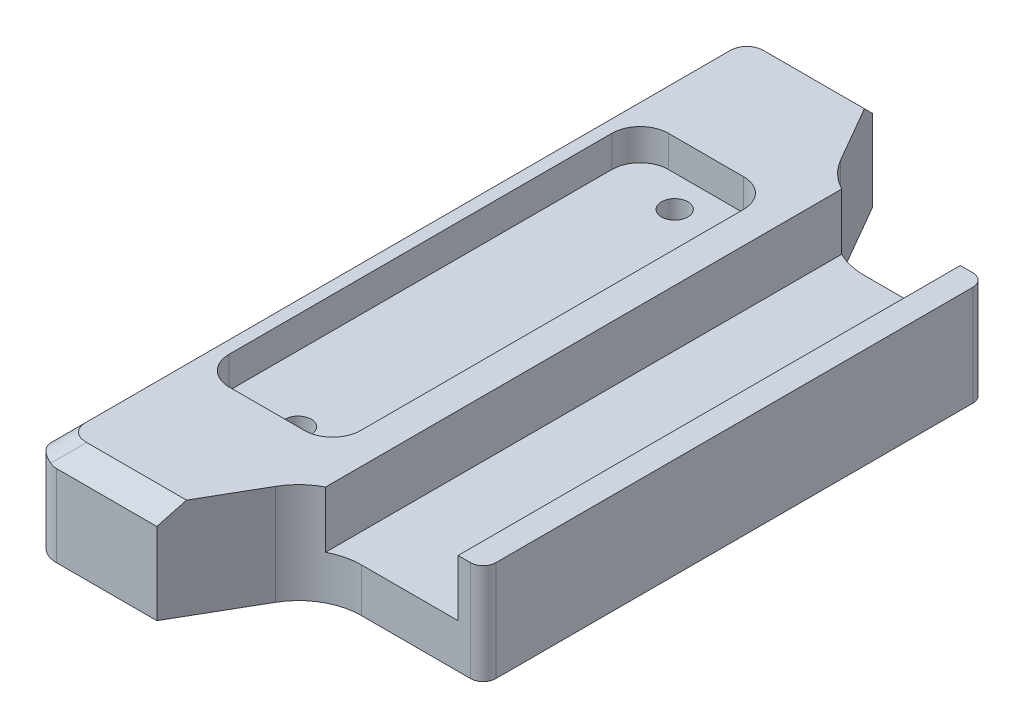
ISO-10303-21;
HEADER;
FILE_DESCRIPTION(('STEP AP214'),'2;1');
FILE_NAME('part.step','',(''),(''),'','','');
FILE_SCHEMA(('AUTOMOTIVE_DESIGN { 1 0 10303 214 1 1 1 1 }'));
ENDSEC;
DATA;
#1=APPLICATION_CONTEXT('core data for automotive mechanical design processes');
#2=APPLICATION_PROTOCOL_DEFINITION('international standard','automotive_design',2000,#1);
#3=PRODUCT_CONTEXT('',#1,'mechanical');
#4=PRODUCT('Part','Part','',(#3));
#5=PRODUCT_RELATED_PRODUCT_CATEGORY('part','',(#4));
#6=PRODUCT_DEFINITION_FORMATION('','',#4);
#7=PRODUCT_DEFINITION_CONTEXT('part definition',#1,'design');
#8=PRODUCT_DEFINITION('design','',#6,#7);
#9=PRODUCT_DEFINITION_SHAPE('','',#8);
#10=(LENGTH_UNIT() NAMED_UNIT(*) SI_UNIT(.MILLI.,.METRE.));
#11=(NAMED_UNIT(*) PLANE_ANGLE_UNIT() SI_UNIT($,.RADIAN.));
#12=(NAMED_UNIT(*) SI_UNIT($,.STERADIAN.) SOLID_ANGLE_UNIT());
#13=UNCERTAINTY_MEASURE_WITH_UNIT(LENGTH_MEASURE(1.E-05),#10,'distance_accuracy_value','');
#14=(GEOMETRIC_REPRESENTATION_CONTEXT(3) GLOBAL_UNCERTAINTY_ASSIGNED_CONTEXT((#13)) GLOBAL_UNIT_ASSIGNED_CONTEXT((#10,
#11,#12)) REPRESENTATION_CONTEXT('',''));
#15=CARTESIAN_POINT('',(0.,0.,0.));
#16=DIRECTION('',(0.,0.,1.));
#17=DIRECTION('',(1.,0.,0.));
#18=AXIS2_PLACEMENT_3D('',#15,#16,#17);
#19=CARTESIAN_POINT('',(0.,16.,57.));
#20=DIRECTION('',(0.,-1.,0.));
#21=DIRECTION('',(1.,0.,0.));
#22=AXIS2_PLACEMENT_3D('',#19,#20,#21);
#23=PLANE('',#22);
#24=DIRECTION('',(-1.,0.,0.));
#25=VECTOR('',#24,1.);
#26=CARTESIAN_POINT('',(55.,16.,40.));
#27=LINE('',#26,#25);
#28=CARTESIAN_POINT('',(53.,16.,40.));
#29=VERTEX_POINT('',#28);
#30=CARTESIAN_POINT('',(51.,16.,40.));
#31=VERTEX_POINT('',#30);
#32=EDGE_CURVE('E375',#29,#31,#27,.T.);
#33=ORIENTED_EDGE('',*,*,#32,.F.);
#34=CARTESIAN_POINT('',(53.,16.,38.));
#35=DIRECTION('',(0.,-1.,0.));
#36=DIRECTION('',(1.,0.,0.));
#37=AXIS2_PLACEMENT_3D('',#34,#35,#36);
#38=CIRCLE('',#37,2.);
#39=CARTESIAN_POINT('',(55.,16.,38.));
#40=VERTEX_POINT('',#39);
#41=EDGE_CURVE('E53',#29,#40,#38,.F.);
#42=ORIENTED_EDGE('',*,*,#41,.T.);
#43=DIRECTION('',(0.,0.,-1.));
#44=VECTOR('',#43,1.);
#45=CARTESIAN_POINT('',(55.,16.,57.));
#46=LINE('',#45,#44);
#47=CARTESIAN_POINT('',(55.,16.,-38.));
#48=VERTEX_POINT('',#47);
#49=EDGE_CURVE('E400',#40,#48,#46,.T.);
#50=ORIENTED_EDGE('',*,*,#49,.T.);
#51=CARTESIAN_POINT('',(53.,16.,-38.));
#52=DIRECTION('',(0.,-1.,0.));
#53=DIRECTION('',(1.,0.,0.));
#54=AXIS2_PLACEMENT_3D('',#51,#52,#53);
#55=CIRCLE('',#54,2.);
#56=CARTESIAN_POINT('',(53.,16.,-40.));
#57=VERTEX_POINT('',#56);
#58=EDGE_CURVE('E360',#48,#57,#55,.F.);
#59=ORIENTED_EDGE('',*,*,#58,.T.);
#60=DIRECTION('',(1.,0.,0.));
#61=VECTOR('',#60,1.);
#62=CARTESIAN_POINT('',(55.,16.,-40.));
#63=LINE('',#62,#61);
#64=CARTESIAN_POINT('',(51.,16.,-40.));
#65=VERTEX_POINT('',#64);
#66=EDGE_CURVE('E542',#65,#57,#63,.T.);
#67=ORIENTED_EDGE('',*,*,#66,.F.);
#68=DIRECTION('',(0.,0.,1.));
#69=VECTOR('',#68,1.);
#70=CARTESIAN_POINT('',(51.,16.,-57.));
#71=LINE('',#70,#69);
#72=EDGE_CURVE('E253',#65,#31,#71,.T.);
#73=ORIENTED_EDGE('',*,*,#72,.T.);
#74=EDGE_LOOP('',(#33,#42,#50,#59,#67,#73));
#75=FACE_BOUND('',#74,.T.);
#76=ADVANCED_FACE('F31',(#75),#23,.F.);
#77=CARTESIAN_POINT('',(0.,0.,57.));
#78=DIRECTION('',(0.,1.,0.));
#79=DIRECTION('',(-1.,0.,0.));
#80=AXIS2_PLACEMENT_3D('',#77,#78,#79);
#81=PLANE('',#80);
#82=CARTESIAN_POINT('',(15.5,0.,-30.));
#83=DIRECTION('',(0.,-1.,0.));
#84=DIRECTION('',(0.,0.,-1.));
#85=AXIS2_PLACEMENT_3D('',#82,#83,#84);
#86=CIRCLE('',#85,3.6);
#87=CARTESIAN_POINT('',(15.5,0.,-33.6));
#88=VERTEX_POINT('',#87);
#89=EDGE_CURVE('E583',#88,#88,#86,.T.);
#90=ORIENTED_EDGE('',*,*,#89,.F.);
#91=EDGE_LOOP('',(#90));
#92=FACE_BOUND('',#91,.T.);
#93=DIRECTION('',(0.,0.,-1.));
#94=VECTOR('',#93,1.);
#95=CARTESIAN_POINT('',(55.,0.,57.));
#96=LINE('',#95,#94);
#97=CARTESIAN_POINT('',(55.,0.,38.));
#98=VERTEX_POINT('',#97);
#99=CARTESIAN_POINT('',(55.,0.,-38.));
#100=VERTEX_POINT('',#99);
#101=EDGE_CURVE('E403',#98,#100,#96,.T.);
#102=ORIENTED_EDGE('',*,*,#101,.F.);
#103=CARTESIAN_POINT('',(53.,0.,38.));
#104=DIRECTION('',(0.,1.,0.));
#105=DIRECTION('',(-1.,0.,0.));
#106=AXIS2_PLACEMENT_3D('',#103,#104,#105);
#107=CIRCLE('',#106,2.);
#108=CARTESIAN_POINT('',(53.,0.,40.));
#109=VERTEX_POINT('',#108);
#110=EDGE_CURVE('E11',#98,#109,#107,.F.);
#111=ORIENTED_EDGE('',*,*,#110,.T.);
#112=DIRECTION('',(-1.,0.,0.));
#113=VECTOR('',#112,1.);
#114=CARTESIAN_POINT('',(55.,0.,40.));
#115=LINE('',#114,#113);
#116=CARTESIAN_POINT('',(35.5884572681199,0.,40.));
#117=VERTEX_POINT('',#116);
#118=EDGE_CURVE('E377',#109,#117,#115,.T.);
#119=ORIENTED_EDGE('',*,*,#118,.T.);
#120=CARTESIAN_POINT('',(35.5884572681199,0.,50.));
#121=DIRECTION('',(0.,1.,0.));
#122=DIRECTION('',(-1.,0.,0.));
#123=AXIS2_PLACEMENT_3D('',#120,#121,#122);
#124=CIRCLE('',#123,10.);
#125=CARTESIAN_POINT('',(26.9282032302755,0.,45.));
#126=VERTEX_POINT('',#125);
#127=EDGE_CURVE('E269',#117,#126,#124,.T.);
#128=ORIENTED_EDGE('',*,*,#127,.T.);
#129=DIRECTION('',(-0.499999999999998,0.,0.86602540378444));
#130=VECTOR('',#129,1.);
#131=CARTESIAN_POINT('',(29.8149545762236,0.,40.));
#132=LINE('',#131,#130);
#133=CARTESIAN_POINT('',(20.,0.,57.));
#134=VERTEX_POINT('',#133);
#135=EDGE_CURVE('E391',#126,#134,#132,.T.);
#136=ORIENTED_EDGE('',*,*,#135,.T.);
#137=DIRECTION('',(1.,0.,0.));
#138=VECTOR('',#137,1.);
#139=CARTESIAN_POINT('',(0.,0.,57.));
#140=LINE('',#139,#138);
#141=CARTESIAN_POINT('',(4.,0.,57.));
#142=VERTEX_POINT('',#141);
#143=EDGE_CURVE('E398',#142,#134,#140,.T.);
#144=ORIENTED_EDGE('',*,*,#143,.F.);
#145=CARTESIAN_POINT('',(4.,0.,53.));
#146=DIRECTION('',(0.,1.,0.));
#147=DIRECTION('',(-1.,0.,0.));
#148=AXIS2_PLACEMENT_3D('',#145,#146,#147);
#149=CIRCLE('',#148,4.);
#150=CARTESIAN_POINT('',(0.,0.,53.));
#151=VERTEX_POINT('',#150);
#152=EDGE_CURVE('E276',#142,#151,#149,.F.);
#153=ORIENTED_EDGE('',*,*,#152,.T.);
#154=DIRECTION('',(0.,0.,-1.));
#155=VECTOR('',#154,1.);
#156=CARTESIAN_POINT('',(0.,0.,57.));
#157=LINE('',#156,#155);
#158=CARTESIAN_POINT('',(0.,0.,-53.));
#159=VERTEX_POINT('',#158);
#160=EDGE_CURVE('E405',#151,#159,#157,.T.);
#161=ORIENTED_EDGE('',*,*,#160,.T.);
#162=CARTESIAN_POINT('',(4.,0.,-53.));
#163=DIRECTION('',(0.,1.,0.));
#164=DIRECTION('',(-1.,0.,0.));
#165=AXIS2_PLACEMENT_3D('',#162,#163,#164);
#166=CIRCLE('',#165,4.);
#167=CARTESIAN_POINT('',(4.,0.,-57.));
#168=VERTEX_POINT('',#167);
#169=EDGE_CURVE('E274',#159,#168,#166,.F.);
#170=ORIENTED_EDGE('',*,*,#169,.T.);
#171=DIRECTION('',(1.,0.,0.));
#172=VECTOR('',#171,1.);
#173=CARTESIAN_POINT('',(0.,0.,-57.));
#174=LINE('',#173,#172);
#175=CARTESIAN_POINT('',(20.,0.,-57.));
#176=VERTEX_POINT('',#175);
#177=EDGE_CURVE('E397',#168,#176,#174,.T.);
#178=ORIENTED_EDGE('',*,*,#177,.T.);
#179=DIRECTION('',(0.499999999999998,0.,0.86602540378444));
#180=VECTOR('',#179,1.);
#181=CARTESIAN_POINT('',(29.8149545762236,0.,-40.));
#182=LINE('',#181,#180);
#183=CARTESIAN_POINT('',(26.9282032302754,0.,-45.));
#184=VERTEX_POINT('',#183);
#185=EDGE_CURVE('E482',#176,#184,#182,.T.);
#186=ORIENTED_EDGE('',*,*,#185,.T.);
#187=CARTESIAN_POINT('',(35.5884572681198,0.,-50.));
#188=DIRECTION('',(0.,1.,0.));
#189=DIRECTION('',(-1.,0.,0.));
#190=AXIS2_PLACEMENT_3D('',#187,#188,#189);
#191=CIRCLE('',#190,10.);
#192=CARTESIAN_POINT('',(35.5884572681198,0.,-40.));
#193=VERTEX_POINT('',#192);
#194=EDGE_CURVE('E259',#184,#193,#191,.T.);
#195=ORIENTED_EDGE('',*,*,#194,.T.);
#196=DIRECTION('',(1.,0.,0.));
#197=VECTOR('',#196,1.);
#198=CARTESIAN_POINT('',(55.,0.,-40.));
#199=LINE('',#198,#197);
#200=CARTESIAN_POINT('',(53.,0.,-40.));
#201=VERTEX_POINT('',#200);
#202=EDGE_CURVE('E388',#193,#201,#199,.T.);
#203=ORIENTED_EDGE('',*,*,#202,.T.);
#204=CARTESIAN_POINT('',(53.,0.,-38.));
#205=DIRECTION('',(0.,1.,0.));
#206=DIRECTION('',(-1.,0.,0.));
#207=AXIS2_PLACEMENT_3D('',#204,#205,#206);
#208=CIRCLE('',#207,2.);
#209=EDGE_CURVE('E364',#201,#100,#208,.F.);
#210=ORIENTED_EDGE('',*,*,#209,.T.);
#211=EDGE_LOOP('',(#102,#111,#119,#128,#136,#144,#153,#161,#170,#178,#186,#195,#203,#210));
#212=FACE_BOUND('',#211,.T.);
#213=CARTESIAN_POINT('',(15.5,0.,30.));
#214=DIRECTION('',(0.,-1.,0.));
#215=DIRECTION('',(0.,0.,-1.));
#216=AXIS2_PLACEMENT_3D('',#213,#214,#215);
#217=CIRCLE('',#216,3.6);
#218=CARTESIAN_POINT('',(15.5,0.,26.4));
#219=VERTEX_POINT('',#218);
#220=EDGE_CURVE('E565',#219,#219,#217,.T.);
#221=ORIENTED_EDGE('',*,*,#220,.F.);
#222=EDGE_LOOP('',(#221));
#223=FACE_BOUND('',#222,.T.);
#224=ADVANCED_FACE('F471',(#92,#212,#223),#81,.F.);
#225=CARTESIAN_POINT('',(0.,0.,57.));
#226=DIRECTION('',(1.,0.,0.));
#227=DIRECTION('',(0.,0.,-1.));
#228=AXIS2_PLACEMENT_3D('',#225,#226,#227);
#229=PLANE('',#228);
#230=ORIENTED_EDGE('',*,*,#160,.F.);
#231=DIRECTION('',(0.,-1.,0.));
#232=VECTOR('',#231,1.);
#233=CARTESIAN_POINT('',(0.,0.,53.));
#234=LINE('',#233,#232);
#235=CARTESIAN_POINT('',(0.,13.,53.));
#236=VERTEX_POINT('',#235);
#237=EDGE_CURVE('E281',#151,#236,#234,.F.);
#238=ORIENTED_EDGE('',*,*,#237,.T.);
#239=DIRECTION('',(0.,0.,-1.));
#240=VECTOR('',#239,1.);
#241=CARTESIAN_POINT('',(0.,13.,57.));
#242=LINE('',#241,#240);
#243=CARTESIAN_POINT('',(0.,13.,-53.));
#244=VERTEX_POINT('',#243);
#245=EDGE_CURVE('E419',#236,#244,#242,.T.);
#246=ORIENTED_EDGE('',*,*,#245,.T.);
#247=DIRECTION('',(0.,-1.,0.));
#248=VECTOR('',#247,1.);
#249=CARTESIAN_POINT('',(0.,0.,-53.));
#250=LINE('',#249,#248);
#251=EDGE_CURVE('E278',#244,#159,#250,.T.);
#252=ORIENTED_EDGE('',*,*,#251,.T.);
#253=EDGE_LOOP('',(#230,#238,#246,#252));
#254=FACE_BOUND('',#253,.T.);
#255=ADVANCED_FACE('F464',(#254),#229,.F.);
#256=CARTESIAN_POINT('',(55.,0.,57.));
#257=DIRECTION('',(-1.,0.,0.));
#258=DIRECTION('',(0.,0.,1.));
#259=AXIS2_PLACEMENT_3D('',#256,#257,#258);
#260=PLANE('',#259);
#261=ORIENTED_EDGE('',*,*,#49,.F.);
#262=DIRECTION('',(0.,1.,0.));
#263=VECTOR('',#262,1.);
#264=CARTESIAN_POINT('',(55.,0.,38.));
#265=LINE('',#264,#263);
#266=EDGE_CURVE('E39',#40,#98,#265,.F.);
#267=ORIENTED_EDGE('',*,*,#266,.T.);
#268=ORIENTED_EDGE('',*,*,#101,.T.);
#269=DIRECTION('',(0.,1.,0.));
#270=VECTOR('',#269,1.);
#271=CARTESIAN_POINT('',(55.,0.,-38.));
#272=LINE('',#271,#270);
#273=EDGE_CURVE('E357',#100,#48,#272,.T.);
#274=ORIENTED_EDGE('',*,*,#273,.T.);
#275=EDGE_LOOP('',(#261,#267,#268,#274));
#276=FACE_BOUND('',#275,.T.);
#277=ADVANCED_FACE('F512',(#276),#260,.F.);
#278=DIRECTION('',(-1.,0.,0.));
#279=VECTOR('',#278,1.);
#280=CARTESIAN_POINT('',(26.,16.,-35.));
#281=LINE('',#280,#279);
#282=CARTESIAN_POINT('',(21.5,16.,-35.));
#283=VERTEX_POINT('',#282);
#284=CARTESIAN_POINT('',(9.49999999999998,16.,-35.));
#285=VERTEX_POINT('',#284);
#286=EDGE_CURVE('E522',#283,#285,#281,.T.);
#287=ORIENTED_EDGE('',*,*,#286,.F.);
#288=CARTESIAN_POINT('',(21.5,16.,-30.5));
#289=DIRECTION('',(0.,-1.,0.));
#290=DIRECTION('',(1.,0.,0.));
#291=AXIS2_PLACEMENT_3D('',#288,#289,#290);
#292=CIRCLE('',#291,4.5);
#293=CARTESIAN_POINT('',(26.,16.,-30.5));
#294=VERTEX_POINT('',#293);
#295=EDGE_CURVE('E345',#283,#294,#292,.T.);
#296=ORIENTED_EDGE('',*,*,#295,.T.);
#297=DIRECTION('',(0.,0.,-1.));
#298=VECTOR('',#297,1.);
#299=CARTESIAN_POINT('',(26.,16.,35.));
#300=LINE('',#299,#298);
#301=CARTESIAN_POINT('',(26.,16.,30.5));
#302=VERTEX_POINT('',#301);
#303=EDGE_CURVE('E529',#302,#294,#300,.T.);
#304=ORIENTED_EDGE('',*,*,#303,.F.);
#305=CARTESIAN_POINT('',(21.5,16.,30.5));
#306=DIRECTION('',(0.,-1.,0.));
#307=DIRECTION('',(1.,0.,0.));
#308=AXIS2_PLACEMENT_3D('',#305,#306,#307);
#309=CIRCLE('',#308,4.5);
#310=CARTESIAN_POINT('',(21.5,16.,35.));
#311=VERTEX_POINT('',#310);
#312=EDGE_CURVE('E347',#302,#311,#309,.T.);
#313=ORIENTED_EDGE('',*,*,#312,.T.);
#314=DIRECTION('',(1.,0.,0.));
#315=VECTOR('',#314,1.);
#316=CARTESIAN_POINT('',(26.,16.,35.));
#317=LINE('',#316,#315);
#318=CARTESIAN_POINT('',(9.49999999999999,16.,35.));
#319=VERTEX_POINT('',#318);
#320=EDGE_CURVE('E532',#319,#311,#317,.T.);
#321=ORIENTED_EDGE('',*,*,#320,.F.);
#322=CARTESIAN_POINT('',(9.49999999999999,16.,30.5));
#323=DIRECTION('',(0.,-1.,0.));
#324=DIRECTION('',(1.,0.,0.));
#325=AXIS2_PLACEMENT_3D('',#322,#323,#324);
#326=CIRCLE('',#325,4.5);
#327=CARTESIAN_POINT('',(4.99999999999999,16.,30.5));
#328=VERTEX_POINT('',#327);
#329=EDGE_CURVE('E341',#319,#328,#326,.T.);
#330=ORIENTED_EDGE('',*,*,#329,.T.);
#331=DIRECTION('',(0.,0.,1.));
#332=VECTOR('',#331,1.);
#333=CARTESIAN_POINT('',(4.99999999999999,16.,35.));
#334=LINE('',#333,#332);
#335=CARTESIAN_POINT('',(4.99999999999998,16.,-30.5));
#336=VERTEX_POINT('',#335);
#337=EDGE_CURVE('E528',#336,#328,#334,.T.);
#338=ORIENTED_EDGE('',*,*,#337,.F.);
#339=CARTESIAN_POINT('',(9.49999999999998,16.,-30.5));
#340=DIRECTION('',(0.,-1.,0.));
#341=DIRECTION('',(1.,0.,0.));
#342=AXIS2_PLACEMENT_3D('',#339,#340,#341);
#343=CIRCLE('',#342,4.5);
#344=EDGE_CURVE('E343',#336,#285,#343,.T.);
#345=ORIENTED_EDGE('',*,*,#344,.T.);
#346=EDGE_LOOP('',(#287,#296,#304,#313,#321,#330,#338,#345));
#347=FACE_BOUND('',#346,.T.);
#348=CARTESIAN_POINT('',(35.5884572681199,16.,50.));
#349=DIRECTION('',(0.,-1.,0.));
#350=DIRECTION('',(1.,0.,0.));
#351=AXIS2_PLACEMENT_3D('',#348,#349,#350);
#352=CIRCLE('',#351,10.);
#353=CARTESIAN_POINT('',(26.9282032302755,16.,45.));
#354=VERTEX_POINT('',#353);
#355=CARTESIAN_POINT('',(31.,16.,41.1148404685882));
#356=VERTEX_POINT('',#355);
#357=EDGE_CURVE('E252',#354,#356,#352,.T.);
#358=ORIENTED_EDGE('',*,*,#357,.T.);
#359=DIRECTION('',(0.,0.,1.));
#360=VECTOR('',#359,1.);
#361=CARTESIAN_POINT('',(31.,16.,-57.));
#362=LINE('',#361,#360);
#363=CARTESIAN_POINT('',(31.,16.,-41.1148404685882));
#364=VERTEX_POINT('',#363);
#365=EDGE_CURVE('E235',#364,#356,#362,.T.);
#366=ORIENTED_EDGE('',*,*,#365,.F.);
#367=CARTESIAN_POINT('',(35.5884572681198,16.,-50.));
#368=DIRECTION('',(0.,-1.,0.));
#369=DIRECTION('',(1.,0.,0.));
#370=AXIS2_PLACEMENT_3D('',#367,#368,#369);
#371=CIRCLE('',#370,10.);
#372=CARTESIAN_POINT('',(26.9282032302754,16.,-45.));
#373=VERTEX_POINT('',#372);
#374=EDGE_CURVE('E249',#364,#373,#371,.T.);
#375=ORIENTED_EDGE('',*,*,#374,.T.);
#376=DIRECTION('',(0.499999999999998,0.,0.86602540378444));
#377=VECTOR('',#376,1.);
#378=CARTESIAN_POINT('',(29.8149545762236,16.,-40.));
#379=LINE('',#378,#377);
#380=CARTESIAN_POINT('',(21.7320508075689,16.,-54.));
#381=VERTEX_POINT('',#380);
#382=EDGE_CURVE('E488',#381,#373,#379,.T.);
#383=ORIENTED_EDGE('',*,*,#382,.F.);
#384=DIRECTION('',(-1.,0.,0.));
#385=VECTOR('',#384,1.);
#386=CARTESIAN_POINT('',(0.,16.,-54.));
#387=LINE('',#386,#385);
#388=CARTESIAN_POINT('',(5.82842712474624,16.,-54.));
#389=VERTEX_POINT('',#388);
#390=EDGE_CURVE('E411',#381,#389,#387,.T.);
#391=ORIENTED_EDGE('',*,*,#390,.T.);
#392=CARTESIAN_POINT('',(8.65685424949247,16.,-48.3431457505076));
#393=DIRECTION('',(0.,-1.,0.));
#394=DIRECTION('',(0.707106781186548,0.,0.707106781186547));
#395=AXIS2_PLACEMENT_3D('',#392,#393,#394);
#396=ELLIPSE('',#395,6.92820323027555,4.);
#397=CARTESIAN_POINT('',(3.00000000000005,16.,-51.1715728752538));
#398=VERTEX_POINT('',#397);
#399=EDGE_CURVE('E306',#389,#398,#396,.F.);
#400=ORIENTED_EDGE('',*,*,#399,.T.);
#401=DIRECTION('',(0.,0.,1.));
#402=VECTOR('',#401,1.);
#403=CARTESIAN_POINT('',(3.00000000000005,16.,57.));
#404=LINE('',#403,#402);
#405=CARTESIAN_POINT('',(3.00000000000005,16.,51.1715728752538));
#406=VERTEX_POINT('',#405);
#407=EDGE_CURVE('E414',#398,#406,#404,.T.);
#408=ORIENTED_EDGE('',*,*,#407,.T.);
#409=CARTESIAN_POINT('',(8.65685424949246,16.,48.3431457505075));
#410=DIRECTION('',(0.,-1.,0.));
#411=DIRECTION('',(-0.707106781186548,0.,0.707106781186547));
#412=AXIS2_PLACEMENT_3D('',#409,#410,#411);
#413=ELLIPSE('',#412,6.92820323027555,4.);
#414=CARTESIAN_POINT('',(5.82842712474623,16.,54.));
#415=VERTEX_POINT('',#414);
#416=EDGE_CURVE('E304',#406,#415,#413,.F.);
#417=ORIENTED_EDGE('',*,*,#416,.T.);
#418=DIRECTION('',(1.,0.,0.));
#419=VECTOR('',#418,1.);
#420=CARTESIAN_POINT('',(0.,16.,54.));
#421=LINE('',#420,#419);
#422=CARTESIAN_POINT('',(21.7320508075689,16.,54.));
#423=VERTEX_POINT('',#422);
#424=EDGE_CURVE('E417',#415,#423,#421,.T.);
#425=ORIENTED_EDGE('',*,*,#424,.T.);
#426=DIRECTION('',(-0.499999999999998,0.,0.86602540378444));
#427=VECTOR('',#426,1.);
#428=CARTESIAN_POINT('',(29.8149545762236,16.,40.));
#429=LINE('',#428,#427);
#430=EDGE_CURVE('E382',#354,#423,#429,.T.);
#431=ORIENTED_EDGE('',*,*,#430,.F.);
#432=EDGE_LOOP('',(#358,#366,#375,#383,#391,#400,#408,#417,#425,#431));
#433=FACE_BOUND('',#432,.T.);
#434=ADVANCED_FACE('F247',(#347,#433),#23,.F.);
#435=CARTESIAN_POINT('',(0.,16.,57.));
#436=DIRECTION('',(0.,0.,-1.));
#437=DIRECTION('',(-1.,0.,0.));
#438=AXIS2_PLACEMENT_3D('',#435,#436,#437);
#439=PLANE('',#438);
#440=DIRECTION('',(-1.,0.,0.));
#441=VECTOR('',#440,1.);
#442=CARTESIAN_POINT('',(0.,13.,57.));
#443=LINE('',#442,#441);
#444=CARTESIAN_POINT('',(20.,13.,57.));
#445=VERTEX_POINT('',#444);
#446=CARTESIAN_POINT('',(4.,13.,57.));
#447=VERTEX_POINT('',#446);
#448=EDGE_CURVE('E408',#445,#447,#443,.T.);
#449=ORIENTED_EDGE('',*,*,#448,.T.);
#450=DIRECTION('',(0.,-1.,0.));
#451=VECTOR('',#450,1.);
#452=CARTESIAN_POINT('',(4.,16.,57.));
#453=LINE('',#452,#451);
#454=EDGE_CURVE('E271',#447,#142,#453,.T.);
#455=ORIENTED_EDGE('',*,*,#454,.T.);
#456=ORIENTED_EDGE('',*,*,#143,.T.);
#457=DIRECTION('',(0.,1.,0.));
#458=VECTOR('',#457,1.);
#459=CARTESIAN_POINT('',(20.,0.,57.));
#460=LINE('',#459,#458);
#461=EDGE_CURVE('E394',#134,#445,#460,.T.);
#462=ORIENTED_EDGE('',*,*,#461,.T.);
#463=EDGE_LOOP('',(#449,#455,#456,#462));
#464=FACE_BOUND('',#463,.T.);
#465=ADVANCED_FACE('F511',(#464),#439,.F.);
#466=CARTESIAN_POINT('',(0.,16.,-57.));
#467=DIRECTION('',(0.,0.,-1.));
#468=DIRECTION('',(-1.,0.,0.));
#469=AXIS2_PLACEMENT_3D('',#466,#467,#468);
#470=PLANE('',#469);
#471=ORIENTED_EDGE('',*,*,#177,.F.);
#472=DIRECTION('',(0.,-1.,0.));
#473=VECTOR('',#472,1.);
#474=CARTESIAN_POINT('',(4.,13.,-57.));
#475=LINE('',#474,#473);
#476=CARTESIAN_POINT('',(4.,13.,-57.));
#477=VERTEX_POINT('',#476);
#478=EDGE_CURVE('E290',#168,#477,#475,.F.);
#479=ORIENTED_EDGE('',*,*,#478,.T.);
#480=DIRECTION('',(1.,0.,0.));
#481=VECTOR('',#480,1.);
#482=CARTESIAN_POINT('',(55.,13.,-57.));
#483=LINE('',#482,#481);
#484=CARTESIAN_POINT('',(20.,13.,-57.));
#485=VERTEX_POINT('',#484);
#486=EDGE_CURVE('E422',#477,#485,#483,.T.);
#487=ORIENTED_EDGE('',*,*,#486,.T.);
#488=DIRECTION('',(0.,1.,0.));
#489=VECTOR('',#488,1.);
#490=CARTESIAN_POINT('',(20.,0.,-57.));
#491=LINE('',#490,#489);
#492=EDGE_CURVE('E383',#176,#485,#491,.T.);
#493=ORIENTED_EDGE('',*,*,#492,.F.);
#494=EDGE_LOOP('',(#471,#479,#487,#493));
#495=FACE_BOUND('',#494,.T.);
#496=ADVANCED_FACE('F477',(#495),#470,.T.);
#497=CARTESIAN_POINT('',(0.,16.,-54.));
#498=DIRECTION('',(0.,0.70710678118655,-0.707106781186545));
#499=DIRECTION('',(0.,0.707106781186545,0.70710678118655));
#500=AXIS2_PLACEMENT_3D('',#497,#498,#499);
#501=PLANE('',#500);
#502=CARTESIAN_POINT('',(4.,16.9999999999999,-53.));
#503=DIRECTION('',(0.,0.70710678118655,-0.707106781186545));
#504=DIRECTION('',(0.,0.707106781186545,0.70710678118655));
#505=AXIS2_PLACEMENT_3D('',#502,#503,#504);
#506=ELLIPSE('',#505,5.65685424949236,4.);
#507=CARTESIAN_POINT('',(2.96472381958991,13.1362966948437,-56.8637033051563));
#508=VERTEX_POINT('',#507);
#509=EDGE_CURVE('E292',#477,#508,#506,.T.);
#510=ORIENTED_EDGE('',*,*,#509,.T.);
#511=DIRECTION('',(0.577350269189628,0.577350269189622,0.577350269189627));
#512=VECTOR('',#511,1.);
#513=CARTESIAN_POINT('',(3.88561808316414,14.0571909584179,-55.942809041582));
#514=LINE('',#513,#512);
#515=EDGE_CURVE('E302',#508,#389,#514,.T.);
#516=ORIENTED_EDGE('',*,*,#515,.T.);
#517=ORIENTED_EDGE('',*,*,#390,.F.);
#518=DIRECTION('',(0.377964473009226,0.654653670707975,0.65465367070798));
#519=VECTOR('',#518,1.);
#520=CARTESIAN_POINT('',(18.6274721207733,10.6227119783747,-59.3772880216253));
#521=LINE('',#520,#519);
#522=EDGE_CURVE('E426',#485,#381,#521,.T.);
#523=ORIENTED_EDGE('',*,*,#522,.F.);
#524=ORIENTED_EDGE('',*,*,#486,.F.);
#525=EDGE_LOOP('',(#510,#516,#517,#523,#524));
#526=FACE_BOUND('',#525,.T.);
#527=ADVANCED_FACE('F485',(#526),#501,.T.);
#528=CARTESIAN_POINT('',(0.,13.,57.));
#529=DIRECTION('',(0.707106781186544,-0.707106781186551,0.));
#530=DIRECTION('',(0.707106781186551,0.707106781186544,0.));
#531=AXIS2_PLACEMENT_3D('',#528,#529,#530);
#532=PLANE('',#531);
#533=ORIENTED_EDGE('',*,*,#407,.F.);
#534=DIRECTION('',(-0.577350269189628,-0.577350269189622,-0.577350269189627));
#535=VECTOR('',#534,1.);
#536=CARTESIAN_POINT('',(37.0571909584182,50.0571909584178,-17.1143819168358));
#537=LINE('',#536,#535);
#538=CARTESIAN_POINT('',(0.136296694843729,13.1362966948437,-54.0352761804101));
#539=VERTEX_POINT('',#538);
#540=EDGE_CURVE('E297',#398,#539,#537,.T.);
#541=ORIENTED_EDGE('',*,*,#540,.T.);
#542=CARTESIAN_POINT('',(4.,16.9999999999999,-53.));
#543=DIRECTION('',(0.707106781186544,-0.707106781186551,0.));
#544=DIRECTION('',(0.707106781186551,0.707106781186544,0.));
#545=AXIS2_PLACEMENT_3D('',#542,#543,#544);
#546=ELLIPSE('',#545,5.65685424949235,4.);
#547=EDGE_CURVE('E283',#539,#244,#546,.F.);
#548=ORIENTED_EDGE('',*,*,#547,.T.);
#549=ORIENTED_EDGE('',*,*,#245,.F.);
#550=CARTESIAN_POINT('',(4.,16.9999999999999,53.));
#551=DIRECTION('',(0.707106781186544,-0.707106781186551,0.));
#552=DIRECTION('',(-0.707106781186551,-0.707106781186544,0.));
#553=AXIS2_PLACEMENT_3D('',#550,#551,#552);
#554=ELLIPSE('',#553,5.65685424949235,4.);
#555=CARTESIAN_POINT('',(0.136296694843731,13.1362966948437,54.0352761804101));
#556=VERTEX_POINT('',#555);
#557=EDGE_CURVE('E285',#236,#556,#554,.F.);
#558=ORIENTED_EDGE('',*,*,#557,.T.);
#559=DIRECTION('',(0.577350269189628,0.577350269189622,-0.577350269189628));
#560=VECTOR('',#559,1.);
#561=CARTESIAN_POINT('',(-0.942809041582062,12.0571909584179,55.1143819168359));
#562=LINE('',#561,#560);
#563=EDGE_CURVE('E295',#556,#406,#562,.T.);
#564=ORIENTED_EDGE('',*,*,#563,.T.);
#565=EDGE_LOOP('',(#533,#541,#548,#549,#558,#564));
#566=FACE_BOUND('',#565,.T.);
#567=ADVANCED_FACE('F459',(#566),#532,.F.);
#568=CARTESIAN_POINT('',(0.,13.,57.));
#569=DIRECTION('',(0.,-0.707106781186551,-0.707106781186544));
#570=DIRECTION('',(0.,0.707106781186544,-0.707106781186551));
#571=AXIS2_PLACEMENT_3D('',#568,#569,#570);
#572=PLANE('',#571);
#573=ORIENTED_EDGE('',*,*,#424,.F.);
#574=DIRECTION('',(0.577350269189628,0.577350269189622,-0.577350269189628));
#575=VECTOR('',#574,1.);
#576=CARTESIAN_POINT('',(1.88561808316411,12.0571909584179,57.9428090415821));
#577=LINE('',#576,#575);
#578=CARTESIAN_POINT('',(2.96472381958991,13.1362966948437,56.8637033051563));
#579=VERTEX_POINT('',#578);
#580=EDGE_CURVE('E308',#415,#579,#577,.F.);
#581=ORIENTED_EDGE('',*,*,#580,.T.);
#582=CARTESIAN_POINT('',(4.,16.9999999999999,53.));
#583=DIRECTION('',(0.,-0.707106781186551,-0.707106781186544));
#584=DIRECTION('',(0.,-0.707106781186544,0.707106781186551));
#585=AXIS2_PLACEMENT_3D('',#582,#583,#584);
#586=ELLIPSE('',#585,5.65685424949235,4.);
#587=EDGE_CURVE('E288',#579,#447,#586,.F.);
#588=ORIENTED_EDGE('',*,*,#587,.T.);
#589=ORIENTED_EDGE('',*,*,#448,.F.);
#590=DIRECTION('',(0.377964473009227,0.654653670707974,-0.65465367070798));
#591=VECTOR('',#590,1.);
#592=CARTESIAN_POINT('',(17.1428571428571,8.05128340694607,61.948716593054));
#593=LINE('',#592,#591);
#594=EDGE_CURVE('E424',#423,#445,#593,.F.);
#595=ORIENTED_EDGE('',*,*,#594,.F.);
#596=EDGE_LOOP('',(#573,#581,#588,#589,#595));
#597=FACE_BOUND('',#596,.T.);
#598=ADVANCED_FACE('F445',(#597),#572,.F.);
#599=CARTESIAN_POINT('',(29.8149545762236,0.,40.));
#600=DIRECTION('',(-0.86602540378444,0.,-0.499999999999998));
#601=DIRECTION('',(-0.499999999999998,0.,0.86602540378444));
#602=AXIS2_PLACEMENT_3D('',#599,#600,#601);
#603=PLANE('',#602);
#604=ORIENTED_EDGE('',*,*,#135,.F.);
#605=DIRECTION('',(0.,1.,0.));
#606=VECTOR('',#605,1.);
#607=CARTESIAN_POINT('',(26.9282032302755,16.,45.));
#608=LINE('',#607,#606);
#609=EDGE_CURVE('E264',#126,#354,#608,.T.);
#610=ORIENTED_EDGE('',*,*,#609,.T.);
#611=ORIENTED_EDGE('',*,*,#430,.T.);
#612=ORIENTED_EDGE('',*,*,#594,.T.);
#613=ORIENTED_EDGE('',*,*,#461,.F.);
#614=EDGE_LOOP('',(#604,#610,#611,#612,#613));
#615=FACE_BOUND('',#614,.T.);
#616=ADVANCED_FACE('F435',(#615),#603,.F.);
#617=CARTESIAN_POINT('',(55.,0.,40.));
#618=DIRECTION('',(0.,0.,-1.));
#619=DIRECTION('',(-1.,0.,0.));
#620=AXIS2_PLACEMENT_3D('',#617,#618,#619);
#621=PLANE('',#620);
#622=ORIENTED_EDGE('',*,*,#118,.F.);
#623=DIRECTION('',(0.,1.,0.));
#624=VECTOR('',#623,1.);
#625=CARTESIAN_POINT('',(53.,0.,40.));
#626=LINE('',#625,#624);
#627=EDGE_CURVE('E367',#109,#29,#626,.T.);
#628=ORIENTED_EDGE('',*,*,#627,.T.);
#629=ORIENTED_EDGE('',*,*,#32,.T.);
#630=DIRECTION('',(0.,-1.,0.));
#631=VECTOR('',#630,1.);
#632=CARTESIAN_POINT('',(51.,0.,40.));
#633=LINE('',#632,#631);
#634=CARTESIAN_POINT('',(51.,7.,40.));
#635=VERTEX_POINT('',#634);
#636=EDGE_CURVE('E552',#31,#635,#633,.T.);
#637=ORIENTED_EDGE('',*,*,#636,.T.);
#638=DIRECTION('',(-1.,0.,0.));
#639=VECTOR('',#638,1.);
#640=CARTESIAN_POINT('',(55.,7.,40.));
#641=LINE('',#640,#639);
#642=CARTESIAN_POINT('',(35.5884572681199,7.,40.));
#643=VERTEX_POINT('',#642);
#644=EDGE_CURVE('E242',#635,#643,#641,.T.);
#645=ORIENTED_EDGE('',*,*,#644,.T.);
#646=DIRECTION('',(0.,1.,0.));
#647=VECTOR('',#646,1.);
#648=CARTESIAN_POINT('',(35.5884572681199,0.,40.));
#649=LINE('',#648,#647);
#650=EDGE_CURVE('E260',#643,#117,#649,.F.);
#651=ORIENTED_EDGE('',*,*,#650,.T.);
#652=EDGE_LOOP('',(#622,#628,#629,#637,#645,#651));
#653=FACE_BOUND('',#652,.T.);
#654=ADVANCED_FACE('F373',(#653),#621,.F.);
#655=CARTESIAN_POINT('',(55.,0.,-40.));
#656=DIRECTION('',(0.,0.,1.));
#657=DIRECTION('',(1.,0.,0.));
#658=AXIS2_PLACEMENT_3D('',#655,#656,#657);
#659=PLANE('',#658);
#660=ORIENTED_EDGE('',*,*,#66,.T.);
#661=DIRECTION('',(0.,1.,0.));
#662=VECTOR('',#661,1.);
#663=CARTESIAN_POINT('',(53.,0.,-40.));
#664=LINE('',#663,#662);
#665=EDGE_CURVE('E362',#57,#201,#664,.F.);
#666=ORIENTED_EDGE('',*,*,#665,.T.);
#667=ORIENTED_EDGE('',*,*,#202,.F.);
#668=DIRECTION('',(0.,1.,0.));
#669=VECTOR('',#668,1.);
#670=CARTESIAN_POINT('',(35.5884572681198,16.,-40.));
#671=LINE('',#670,#669);
#672=CARTESIAN_POINT('',(35.5884572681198,7.,-40.));
#673=VERTEX_POINT('',#672);
#674=EDGE_CURVE('E428',#193,#673,#671,.T.);
#675=ORIENTED_EDGE('',*,*,#674,.T.);
#676=DIRECTION('',(1.,0.,0.));
#677=VECTOR('',#676,1.);
#678=CARTESIAN_POINT('',(55.,7.,-40.));
#679=LINE('',#678,#677);
#680=CARTESIAN_POINT('',(51.,7.,-40.));
#681=VERTEX_POINT('',#680);
#682=EDGE_CURVE('E558',#673,#681,#679,.T.);
#683=ORIENTED_EDGE('',*,*,#682,.T.);
#684=DIRECTION('',(0.,1.,0.));
#685=VECTOR('',#684,1.);
#686=CARTESIAN_POINT('',(51.,0.,-40.));
#687=LINE('',#686,#685);
#688=EDGE_CURVE('E354',#681,#65,#687,.T.);
#689=ORIENTED_EDGE('',*,*,#688,.T.);
#690=EDGE_LOOP('',(#660,#666,#667,#675,#683,#689));
#691=FACE_BOUND('',#690,.T.);
#692=ADVANCED_FACE('F654',(#691),#659,.F.);
#693=CARTESIAN_POINT('',(29.8149545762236,0.,-40.));
#694=DIRECTION('',(-0.86602540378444,0.,0.499999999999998));
#695=DIRECTION('',(0.499999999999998,0.,0.86602540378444));
#696=AXIS2_PLACEMENT_3D('',#693,#694,#695);
#697=PLANE('',#696);
#698=ORIENTED_EDGE('',*,*,#382,.T.);
#699=DIRECTION('',(0.,1.,0.));
#700=VECTOR('',#699,1.);
#701=CARTESIAN_POINT('',(26.9282032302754,0.,-45.));
#702=LINE('',#701,#700);
#703=EDGE_CURVE('E258',#373,#184,#702,.F.);
#704=ORIENTED_EDGE('',*,*,#703,.T.);
#705=ORIENTED_EDGE('',*,*,#185,.F.);
#706=ORIENTED_EDGE('',*,*,#492,.T.);
#707=ORIENTED_EDGE('',*,*,#522,.T.);
#708=EDGE_LOOP('',(#698,#704,#705,#706,#707));
#709=FACE_BOUND('',#708,.T.);
#710=ADVANCED_FACE('F481',(#709),#697,.F.);
#711=CARTESIAN_POINT('',(35.5884572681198,0.,-50.));
#712=DIRECTION('',(0.,-1.,0.));
#713=DIRECTION('',(1.,0.,0.));
#714=AXIS2_PLACEMENT_3D('',#711,#712,#713);
#715=CYLINDRICAL_SURFACE('',#714,10.);
#716=DIRECTION('',(0.,-1.,0.));
#717=VECTOR('',#716,1.);
#718=CARTESIAN_POINT('',(31.,0.,-41.1148404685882));
#719=LINE('',#718,#717);
#720=CARTESIAN_POINT('',(31.,7.,-41.1148404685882));
#721=VERTEX_POINT('',#720);
#722=EDGE_CURVE('E232',#364,#721,#719,.T.);
#723=ORIENTED_EDGE('',*,*,#722,.T.);
#724=CARTESIAN_POINT('',(35.5884572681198,7.,-50.));
#725=DIRECTION('',(0.,-1.,0.));
#726=DIRECTION('',(1.,0.,0.));
#727=AXIS2_PLACEMENT_3D('',#724,#725,#726);
#728=CIRCLE('',#727,10.);
#729=EDGE_CURVE('E556',#721,#673,#728,.F.);
#730=ORIENTED_EDGE('',*,*,#729,.T.);
#731=ORIENTED_EDGE('',*,*,#674,.F.);
#732=ORIENTED_EDGE('',*,*,#194,.F.);
#733=ORIENTED_EDGE('',*,*,#703,.F.);
#734=ORIENTED_EDGE('',*,*,#374,.F.);
#735=EDGE_LOOP('',(#723,#730,#731,#732,#733,#734));
#736=FACE_BOUND('',#735,.T.);
#737=ADVANCED_FACE('F256',(#736),#715,.F.);
#738=CARTESIAN_POINT('',(35.5884572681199,0.,50.));
#739=DIRECTION('',(0.,-1.,0.));
#740=DIRECTION('',(1.,0.,0.));
#741=AXIS2_PLACEMENT_3D('',#738,#739,#740);
#742=CYLINDRICAL_SURFACE('',#741,10.);
#743=ORIENTED_EDGE('',*,*,#650,.F.);
#744=CARTESIAN_POINT('',(35.5884572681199,7.,50.));
#745=DIRECTION('',(0.,-1.,0.));
#746=DIRECTION('',(1.,0.,0.));
#747=AXIS2_PLACEMENT_3D('',#744,#745,#746);
#748=CIRCLE('',#747,10.);
#749=CARTESIAN_POINT('',(31.,7.,41.1148404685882));
#750=VERTEX_POINT('',#749);
#751=EDGE_CURVE('E351',#643,#750,#748,.F.);
#752=ORIENTED_EDGE('',*,*,#751,.T.);
#753=DIRECTION('',(0.,-1.,0.));
#754=VECTOR('',#753,1.);
#755=CARTESIAN_POINT('',(31.,0.,41.1148404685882));
#756=LINE('',#755,#754);
#757=EDGE_CURVE('E349',#750,#356,#756,.F.);
#758=ORIENTED_EDGE('',*,*,#757,.T.);
#759=ORIENTED_EDGE('',*,*,#357,.F.);
#760=ORIENTED_EDGE('',*,*,#609,.F.);
#761=ORIENTED_EDGE('',*,*,#127,.F.);
#762=EDGE_LOOP('',(#743,#752,#758,#759,#760,#761));
#763=FACE_BOUND('',#762,.T.);
#764=ADVANCED_FACE('F550',(#763),#742,.F.);
#765=CARTESIAN_POINT('',(4.,16.,53.));
#766=DIRECTION('',(0.,-1.,0.));
#767=DIRECTION('',(0.,0.,-1.));
#768=AXIS2_PLACEMENT_3D('',#765,#766,#767);
#769=CYLINDRICAL_SURFACE('',#768,4.);
#770=ORIENTED_EDGE('',*,*,#587,.F.);
#771=CARTESIAN_POINT('',(4.,11.3431457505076,53.));
#772=DIRECTION('',(-0.32505758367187,-0.888073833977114,0.32505758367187));
#773=DIRECTION('',(0.627963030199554,-0.459700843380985,-0.627963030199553));
#774=AXIS2_PLACEMENT_3D('',#771,#772,#773);
#775=ELLIPSE('',#774,4.50413000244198,4.);
#776=EDGE_CURVE('E311',#579,#556,#775,.T.);
#777=ORIENTED_EDGE('',*,*,#776,.T.);
#778=ORIENTED_EDGE('',*,*,#557,.F.);
#779=ORIENTED_EDGE('',*,*,#237,.F.);
#780=ORIENTED_EDGE('',*,*,#152,.F.);
#781=ORIENTED_EDGE('',*,*,#454,.F.);
#782=EDGE_LOOP('',(#770,#777,#778,#779,#780,#781));
#783=FACE_BOUND('',#782,.T.);
#784=ADVANCED_FACE('F453',(#783),#769,.T.);
#785=CARTESIAN_POINT('',(4.,0.,-53.));
#786=DIRECTION('',(0.,1.,0.));
#787=DIRECTION('',(0.,0.,1.));
#788=AXIS2_PLACEMENT_3D('',#785,#786,#787);
#789=CYLINDRICAL_SURFACE('',#788,4.);
#790=ORIENTED_EDGE('',*,*,#547,.F.);
#791=CARTESIAN_POINT('',(4.,11.3431457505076,-53.));
#792=DIRECTION('',(0.32505758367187,0.888073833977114,0.325057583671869));
#793=DIRECTION('',(-0.627963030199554,0.459700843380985,-0.627963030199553));
#794=AXIS2_PLACEMENT_3D('',#791,#792,#793);
#795=ELLIPSE('',#794,4.50413000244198,4.);
#796=EDGE_CURVE('E300',#539,#508,#795,.F.);
#797=ORIENTED_EDGE('',*,*,#796,.T.);
#798=ORIENTED_EDGE('',*,*,#509,.F.);
#799=ORIENTED_EDGE('',*,*,#478,.F.);
#800=ORIENTED_EDGE('',*,*,#169,.F.);
#801=ORIENTED_EDGE('',*,*,#251,.F.);
#802=EDGE_LOOP('',(#790,#797,#798,#799,#800,#801));
#803=FACE_BOUND('',#802,.T.);
#804=ADVANCED_FACE('F466',(#803),#789,.T.);
#805=CARTESIAN_POINT('',(39.8856180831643,47.2287638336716,-17.1143819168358));
#806=DIRECTION('',(0.577350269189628,0.577350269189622,0.577350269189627));
#807=DIRECTION('',(0.707106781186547,0.,-0.707106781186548));
#808=AXIS2_PLACEMENT_3D('',#805,#806,#807);
#809=CYLINDRICAL_SURFACE('',#808,4.);
#810=ORIENTED_EDGE('',*,*,#399,.F.);
#811=ORIENTED_EDGE('',*,*,#515,.F.);
#812=ORIENTED_EDGE('',*,*,#796,.F.);
#813=ORIENTED_EDGE('',*,*,#540,.F.);
#814=EDGE_LOOP('',(#810,#811,#812,#813));
#815=FACE_BOUND('',#814,.T.);
#816=ADVANCED_FACE('F491',(#815),#809,.T.);
#817=CARTESIAN_POINT('',(1.88561808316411,9.22876383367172,55.1143819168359));
#818=DIRECTION('',(-0.577350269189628,-0.577350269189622,0.577350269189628));
#819=DIRECTION('',(0.707106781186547,0.,0.707106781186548));
#820=AXIS2_PLACEMENT_3D('',#817,#818,#819);
#821=CYLINDRICAL_SURFACE('',#820,4.);
#822=ORIENTED_EDGE('',*,*,#416,.F.);
#823=ORIENTED_EDGE('',*,*,#563,.F.);
#824=ORIENTED_EDGE('',*,*,#776,.F.);
#825=ORIENTED_EDGE('',*,*,#580,.F.);
#826=EDGE_LOOP('',(#822,#823,#824,#825));
#827=FACE_BOUND('',#826,.T.);
#828=ADVANCED_FACE('F449',(#827),#821,.T.);
#829=CARTESIAN_POINT('',(26.,11.,35.));
#830=DIRECTION('',(1.,0.,0.));
#831=DIRECTION('',(0.,0.,-1.));
#832=AXIS2_PLACEMENT_3D('',#829,#830,#831);
#833=PLANE('',#832);
#834=ORIENTED_EDGE('',*,*,#303,.T.);
#835=DIRECTION('',(0.,1.,0.));
#836=VECTOR('',#835,1.);
#837=CARTESIAN_POINT('',(26.,11.,-30.5));
#838=LINE('',#837,#836);
#839=CARTESIAN_POINT('',(26.,11.,-30.5));
#840=VERTEX_POINT('',#839);
#841=EDGE_CURVE('E339',#294,#840,#838,.F.);
#842=ORIENTED_EDGE('',*,*,#841,.T.);
#843=DIRECTION('',(0.,0.,-1.));
#844=VECTOR('',#843,1.);
#845=CARTESIAN_POINT('',(26.,11.,35.));
#846=LINE('',#845,#844);
#847=CARTESIAN_POINT('',(26.,11.,30.5));
#848=VERTEX_POINT('',#847);
#849=EDGE_CURVE('E540',#848,#840,#846,.T.);
#850=ORIENTED_EDGE('',*,*,#849,.F.);
#851=DIRECTION('',(0.,1.,0.));
#852=VECTOR('',#851,1.);
#853=CARTESIAN_POINT('',(26.,16.,30.5));
#854=LINE('',#853,#852);
#855=EDGE_CURVE('E336',#848,#302,#854,.T.);
#856=ORIENTED_EDGE('',*,*,#855,.T.);
#857=EDGE_LOOP('',(#834,#842,#850,#856));
#858=FACE_BOUND('',#857,.T.);
#859=ADVANCED_FACE('F498',(#858),#833,.F.);
#860=CARTESIAN_POINT('',(26.,11.,35.));
#861=DIRECTION('',(0.,0.,1.));
#862=DIRECTION('',(1.,0.,0.));
#863=AXIS2_PLACEMENT_3D('',#860,#861,#862);
#864=PLANE('',#863);
#865=DIRECTION('',(1.,0.,0.));
#866=VECTOR('',#865,1.);
#867=CARTESIAN_POINT('',(26.,11.,35.));
#868=LINE('',#867,#866);
#869=CARTESIAN_POINT('',(9.49999999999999,11.,35.));
#870=VERTEX_POINT('',#869);
#871=CARTESIAN_POINT('',(21.5,11.,35.));
#872=VERTEX_POINT('',#871);
#873=EDGE_CURVE('E546',#870,#872,#868,.T.);
#874=ORIENTED_EDGE('',*,*,#873,.F.);
#875=DIRECTION('',(0.,1.,0.));
#876=VECTOR('',#875,1.);
#877=CARTESIAN_POINT('',(9.49999999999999,16.,35.));
#878=LINE('',#877,#876);
#879=EDGE_CURVE('E315',#870,#319,#878,.T.);
#880=ORIENTED_EDGE('',*,*,#879,.T.);
#881=ORIENTED_EDGE('',*,*,#320,.T.);
#882=DIRECTION('',(0.,1.,0.));
#883=VECTOR('',#882,1.);
#884=CARTESIAN_POINT('',(21.5,11.,35.));
#885=LINE('',#884,#883);
#886=EDGE_CURVE('E313',#311,#872,#885,.F.);
#887=ORIENTED_EDGE('',*,*,#886,.T.);
#888=EDGE_LOOP('',(#874,#880,#881,#887));
#889=FACE_BOUND('',#888,.T.);
#890=ADVANCED_FACE('F611',(#889),#864,.F.);
#891=CARTESIAN_POINT('',(4.99999999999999,11.,35.));
#892=DIRECTION('',(-1.,0.,0.));
#893=DIRECTION('',(0.,0.,1.));
#894=AXIS2_PLACEMENT_3D('',#891,#892,#893);
#895=PLANE('',#894);
#896=ORIENTED_EDGE('',*,*,#337,.T.);
#897=DIRECTION('',(0.,1.,0.));
#898=VECTOR('',#897,1.);
#899=CARTESIAN_POINT('',(4.99999999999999,11.,30.5));
#900=LINE('',#899,#898);
#901=CARTESIAN_POINT('',(4.99999999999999,11.,30.5));
#902=VERTEX_POINT('',#901);
#903=EDGE_CURVE('E321',#328,#902,#900,.F.);
#904=ORIENTED_EDGE('',*,*,#903,.T.);
#905=DIRECTION('',(0.,0.,1.));
#906=VECTOR('',#905,1.);
#907=CARTESIAN_POINT('',(4.99999999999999,11.,35.));
#908=LINE('',#907,#906);
#909=CARTESIAN_POINT('',(4.99999999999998,11.,-30.5));
#910=VERTEX_POINT('',#909);
#911=EDGE_CURVE('E593',#910,#902,#908,.T.);
#912=ORIENTED_EDGE('',*,*,#911,.F.);
#913=DIRECTION('',(0.,1.,0.));
#914=VECTOR('',#913,1.);
#915=CARTESIAN_POINT('',(4.99999999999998,16.,-30.5));
#916=LINE('',#915,#914);
#917=EDGE_CURVE('E318',#910,#336,#916,.T.);
#918=ORIENTED_EDGE('',*,*,#917,.T.);
#919=EDGE_LOOP('',(#896,#904,#912,#918));
#920=FACE_BOUND('',#919,.T.);
#921=ADVANCED_FACE('F616',(#920),#895,.F.);
#922=CARTESIAN_POINT('',(26.,11.,-35.));
#923=DIRECTION('',(0.,0.,-1.));
#924=DIRECTION('',(-1.,0.,0.));
#925=AXIS2_PLACEMENT_3D('',#922,#923,#924);
#926=PLANE('',#925);
#927=ORIENTED_EDGE('',*,*,#286,.T.);
#928=DIRECTION('',(0.,1.,0.));
#929=VECTOR('',#928,1.);
#930=CARTESIAN_POINT('',(9.49999999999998,11.,-35.));
#931=LINE('',#930,#929);
#932=CARTESIAN_POINT('',(9.49999999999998,11.,-35.));
#933=VERTEX_POINT('',#932);
#934=EDGE_CURVE('E334',#285,#933,#931,.F.);
#935=ORIENTED_EDGE('',*,*,#934,.T.);
#936=DIRECTION('',(-1.,0.,0.));
#937=VECTOR('',#936,1.);
#938=CARTESIAN_POINT('',(26.,11.,-35.));
#939=LINE('',#938,#937);
#940=CARTESIAN_POINT('',(21.5,11.,-35.));
#941=VERTEX_POINT('',#940);
#942=EDGE_CURVE('E590',#941,#933,#939,.T.);
#943=ORIENTED_EDGE('',*,*,#942,.F.);
#944=DIRECTION('',(0.,1.,0.));
#945=VECTOR('',#944,1.);
#946=CARTESIAN_POINT('',(21.5,16.,-35.));
#947=LINE('',#946,#945);
#948=EDGE_CURVE('E331',#941,#283,#947,.T.);
#949=ORIENTED_EDGE('',*,*,#948,.T.);
#950=EDGE_LOOP('',(#927,#935,#943,#949));
#951=FACE_BOUND('',#950,.T.);
#952=ADVANCED_FACE('F623',(#951),#926,.F.);
#953=CARTESIAN_POINT('',(26.,11.,-35.));
#954=DIRECTION('',(0.,1.,0.));
#955=DIRECTION('',(0.,0.,1.));
#956=AXIS2_PLACEMENT_3D('',#953,#954,#955);
#957=PLANE('',#956);
#958=CARTESIAN_POINT('',(15.5,11.,30.));
#959=DIRECTION('',(0.,1.,0.));
#960=DIRECTION('',(0.,0.,1.));
#961=AXIS2_PLACEMENT_3D('',#958,#959,#960);
#962=CIRCLE('',#961,2.1);
#963=CARTESIAN_POINT('',(15.5,11.,32.1));
#964=VERTEX_POINT('',#963);
#965=EDGE_CURVE('E574',#964,#964,#962,.T.);
#966=ORIENTED_EDGE('',*,*,#965,.F.);
#967=EDGE_LOOP('',(#966));
#968=FACE_BOUND('',#967,.T.);
#969=CARTESIAN_POINT('',(15.5,11.,-30.));
#970=DIRECTION('',(0.,1.,0.));
#971=DIRECTION('',(0.,0.,1.));
#972=AXIS2_PLACEMENT_3D('',#969,#970,#971);
#973=CIRCLE('',#972,2.1);
#974=CARTESIAN_POINT('',(15.5,11.,-27.9));
#975=VERTEX_POINT('',#974);
#976=EDGE_CURVE('E534',#975,#975,#973,.T.);
#977=ORIENTED_EDGE('',*,*,#976,.F.);
#978=EDGE_LOOP('',(#977));
#979=FACE_BOUND('',#978,.T.);
#980=ORIENTED_EDGE('',*,*,#911,.T.);
#981=CARTESIAN_POINT('',(9.49999999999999,11.,30.5));
#982=DIRECTION('',(0.,1.,0.));
#983=DIRECTION('',(0.,0.,1.));
#984=AXIS2_PLACEMENT_3D('',#981,#982,#983);
#985=CIRCLE('',#984,4.5);
#986=EDGE_CURVE('E329',#902,#870,#985,.T.);
#987=ORIENTED_EDGE('',*,*,#986,.T.);
#988=ORIENTED_EDGE('',*,*,#873,.T.);
#989=CARTESIAN_POINT('',(21.5,11.,30.5));
#990=DIRECTION('',(0.,1.,0.));
#991=DIRECTION('',(0.,0.,1.));
#992=AXIS2_PLACEMENT_3D('',#989,#990,#991);
#993=CIRCLE('',#992,4.5);
#994=EDGE_CURVE('E323',#872,#848,#993,.T.);
#995=ORIENTED_EDGE('',*,*,#994,.T.);
#996=ORIENTED_EDGE('',*,*,#849,.T.);
#997=CARTESIAN_POINT('',(21.5,11.,-30.5));
#998=DIRECTION('',(0.,1.,0.));
#999=DIRECTION('',(0.,0.,1.));
#1000=AXIS2_PLACEMENT_3D('',#997,#998,#999);
#1001=CIRCLE('',#1000,4.5);
#1002=EDGE_CURVE('E325',#840,#941,#1001,.T.);
#1003=ORIENTED_EDGE('',*,*,#1002,.T.);
#1004=ORIENTED_EDGE('',*,*,#942,.T.);
#1005=CARTESIAN_POINT('',(9.49999999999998,11.,-30.5));
#1006=DIRECTION('',(0.,1.,0.));
#1007=DIRECTION('',(0.,0.,1.));
#1008=AXIS2_PLACEMENT_3D('',#1005,#1006,#1007);
#1009=CIRCLE('',#1008,4.5);
#1010=EDGE_CURVE('E327',#933,#910,#1009,.T.);
#1011=ORIENTED_EDGE('',*,*,#1010,.T.);
#1012=EDGE_LOOP('',(#980,#987,#988,#995,#996,#1003,#1004,#1011));
#1013=FACE_BOUND('',#1012,.T.);
#1014=ADVANCED_FACE('F599',(#968,#979,#1013),#957,.T.);
#1015=CARTESIAN_POINT('',(9.49999999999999,11.,30.5));
#1016=DIRECTION('',(0.,-1.,0.));
#1017=DIRECTION('',(1.,0.,0.));
#1018=AXIS2_PLACEMENT_3D('',#1015,#1016,#1017);
#1019=CYLINDRICAL_SURFACE('',#1018,4.5);
#1020=ORIENTED_EDGE('',*,*,#986,.F.);
#1021=ORIENTED_EDGE('',*,*,#903,.F.);
#1022=ORIENTED_EDGE('',*,*,#329,.F.);
#1023=ORIENTED_EDGE('',*,*,#879,.F.);
#1024=EDGE_LOOP('',(#1020,#1021,#1022,#1023));
#1025=FACE_BOUND('',#1024,.T.);
#1026=ADVANCED_FACE('F613',(#1025),#1019,.F.);
#1027=CARTESIAN_POINT('',(9.49999999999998,11.,-30.5));
#1028=DIRECTION('',(0.,-1.,0.));
#1029=DIRECTION('',(1.,0.,0.));
#1030=AXIS2_PLACEMENT_3D('',#1027,#1028,#1029);
#1031=CYLINDRICAL_SURFACE('',#1030,4.5);
#1032=ORIENTED_EDGE('',*,*,#1010,.F.);
#1033=ORIENTED_EDGE('',*,*,#934,.F.);
#1034=ORIENTED_EDGE('',*,*,#344,.F.);
#1035=ORIENTED_EDGE('',*,*,#917,.F.);
#1036=EDGE_LOOP('',(#1032,#1033,#1034,#1035));
#1037=FACE_BOUND('',#1036,.T.);
#1038=ADVANCED_FACE('F621',(#1037),#1031,.F.);
#1039=CARTESIAN_POINT('',(21.5,11.,-30.5));
#1040=DIRECTION('',(0.,-1.,0.));
#1041=DIRECTION('',(1.,0.,0.));
#1042=AXIS2_PLACEMENT_3D('',#1039,#1040,#1041);
#1043=CYLINDRICAL_SURFACE('',#1042,4.5);
#1044=ORIENTED_EDGE('',*,*,#1002,.F.);
#1045=ORIENTED_EDGE('',*,*,#841,.F.);
#1046=ORIENTED_EDGE('',*,*,#295,.F.);
#1047=ORIENTED_EDGE('',*,*,#948,.F.);
#1048=EDGE_LOOP('',(#1044,#1045,#1046,#1047));
#1049=FACE_BOUND('',#1048,.T.);
#1050=ADVANCED_FACE('F627',(#1049),#1043,.F.);
#1051=CARTESIAN_POINT('',(21.5,11.,30.5));
#1052=DIRECTION('',(0.,-1.,0.));
#1053=DIRECTION('',(1.,0.,0.));
#1054=AXIS2_PLACEMENT_3D('',#1051,#1052,#1053);
#1055=CYLINDRICAL_SURFACE('',#1054,4.5);
#1056=ORIENTED_EDGE('',*,*,#994,.F.);
#1057=ORIENTED_EDGE('',*,*,#886,.F.);
#1058=ORIENTED_EDGE('',*,*,#312,.F.);
#1059=ORIENTED_EDGE('',*,*,#855,.F.);
#1060=EDGE_LOOP('',(#1056,#1057,#1058,#1059));
#1061=FACE_BOUND('',#1060,.T.);
#1062=ADVANCED_FACE('F607',(#1061),#1055,.F.);
#1063=CARTESIAN_POINT('',(15.5,0.,-30.));
#1064=DIRECTION('',(0.,-1.,0.));
#1065=DIRECTION('',(0.,0.,-1.));
#1066=AXIS2_PLACEMENT_3D('',#1063,#1064,#1065);
#1067=CYLINDRICAL_SURFACE('',#1066,2.1);
#1068=CARTESIAN_POINT('',(15.5,5.,-30.));
#1069=DIRECTION('',(0.,-1.,0.));
#1070=DIRECTION('',(0.,0.,-1.));
#1071=AXIS2_PLACEMENT_3D('',#1068,#1069,#1070);
#1072=CIRCLE('',#1071,2.1);
#1073=CARTESIAN_POINT('',(15.5,5.,-32.1));
#1074=VERTEX_POINT('',#1073);
#1075=EDGE_CURVE('E577',#1074,#1074,#1072,.T.);
#1076=ORIENTED_EDGE('',*,*,#1075,.T.);
#1077=EDGE_LOOP('',(#1076));
#1078=FACE_BOUND('',#1077,.T.);
#1079=ORIENTED_EDGE('',*,*,#976,.T.);
#1080=EDGE_LOOP('',(#1079));
#1081=FACE_BOUND('',#1080,.T.);
#1082=ADVANCED_FACE('F634',(#1078,#1081),#1067,.F.);
#1083=CARTESIAN_POINT('',(15.5,0.,-30.));
#1084=DIRECTION('',(0.,-1.,0.));
#1085=DIRECTION('',(0.,0.,-1.));
#1086=AXIS2_PLACEMENT_3D('',#1083,#1084,#1085);
#1087=CYLINDRICAL_SURFACE('',#1086,3.6);
#1088=CARTESIAN_POINT('',(15.5,5.,-30.));
#1089=DIRECTION('',(0.,-1.,0.));
#1090=DIRECTION('',(0.,0.,-1.));
#1091=AXIS2_PLACEMENT_3D('',#1088,#1089,#1090);
#1092=CIRCLE('',#1091,3.6);
#1093=CARTESIAN_POINT('',(15.5,5.,-33.6));
#1094=VERTEX_POINT('',#1093);
#1095=EDGE_CURVE('E580',#1094,#1094,#1092,.T.);
#1096=ORIENTED_EDGE('',*,*,#1095,.F.);
#1097=EDGE_LOOP('',(#1096));
#1098=FACE_BOUND('',#1097,.T.);
#1099=ORIENTED_EDGE('',*,*,#89,.T.);
#1100=EDGE_LOOP('',(#1099));
#1101=FACE_BOUND('',#1100,.T.);
#1102=ADVANCED_FACE('F681',(#1098,#1101),#1087,.F.);
#1103=CARTESIAN_POINT('',(17.6,5.,-30.));
#1104=DIRECTION('',(0.,1.,0.));
#1105=DIRECTION('',(0.,0.,1.));
#1106=AXIS2_PLACEMENT_3D('',#1103,#1104,#1105);
#1107=PLANE('',#1106);
#1108=ORIENTED_EDGE('',*,*,#1075,.F.);
#1109=EDGE_LOOP('',(#1108));
#1110=FACE_BOUND('',#1109,.T.);
#1111=ORIENTED_EDGE('',*,*,#1095,.T.);
#1112=EDGE_LOOP('',(#1111));
#1113=FACE_BOUND('',#1112,.T.);
#1114=ADVANCED_FACE('F677',(#1110,#1113),#1107,.F.);
#1115=CARTESIAN_POINT('',(15.5,0.,30.));
#1116=DIRECTION('',(0.,-1.,0.));
#1117=DIRECTION('',(0.,0.,-1.));
#1118=AXIS2_PLACEMENT_3D('',#1115,#1116,#1117);
#1119=CYLINDRICAL_SURFACE('',#1118,2.1);
#1120=CARTESIAN_POINT('',(15.5,5.,30.));
#1121=DIRECTION('',(0.,-1.,0.));
#1122=DIRECTION('',(0.,0.,-1.));
#1123=AXIS2_PLACEMENT_3D('',#1120,#1121,#1122);
#1124=CIRCLE('',#1123,2.1);
#1125=CARTESIAN_POINT('',(15.5,5.,27.9));
#1126=VERTEX_POINT('',#1125);
#1127=EDGE_CURVE('E571',#1126,#1126,#1124,.T.);
#1128=ORIENTED_EDGE('',*,*,#1127,.T.);
#1129=EDGE_LOOP('',(#1128));
#1130=FACE_BOUND('',#1129,.T.);
#1131=ORIENTED_EDGE('',*,*,#965,.T.);
#1132=EDGE_LOOP('',(#1131));
#1133=FACE_BOUND('',#1132,.T.);
#1134=ADVANCED_FACE('F673',(#1130,#1133),#1119,.F.);
#1135=CARTESIAN_POINT('',(17.6,5.,30.));
#1136=DIRECTION('',(0.,1.,0.));
#1137=DIRECTION('',(0.,0.,1.));
#1138=AXIS2_PLACEMENT_3D('',#1135,#1136,#1137);
#1139=PLANE('',#1138);
#1140=ORIENTED_EDGE('',*,*,#1127,.F.);
#1141=EDGE_LOOP('',(#1140));
#1142=FACE_BOUND('',#1141,.T.);
#1143=CARTESIAN_POINT('',(15.5,5.,30.));
#1144=DIRECTION('',(0.,-1.,0.));
#1145=DIRECTION('',(0.,0.,-1.));
#1146=AXIS2_PLACEMENT_3D('',#1143,#1144,#1145);
#1147=CIRCLE('',#1146,3.6);
#1148=CARTESIAN_POINT('',(15.5,5.,26.4));
#1149=VERTEX_POINT('',#1148);
#1150=EDGE_CURVE('E568',#1149,#1149,#1147,.T.);
#1151=ORIENTED_EDGE('',*,*,#1150,.T.);
#1152=EDGE_LOOP('',(#1151));
#1153=FACE_BOUND('',#1152,.T.);
#1154=ADVANCED_FACE('F667',(#1142,#1153),#1139,.F.);
#1155=CARTESIAN_POINT('',(15.5,0.,30.));
#1156=DIRECTION('',(0.,-1.,0.));
#1157=DIRECTION('',(0.,0.,-1.));
#1158=AXIS2_PLACEMENT_3D('',#1155,#1156,#1157);
#1159=CYLINDRICAL_SURFACE('',#1158,3.6);
#1160=ORIENTED_EDGE('',*,*,#1150,.F.);
#1161=EDGE_LOOP('',(#1160));
#1162=FACE_BOUND('',#1161,.T.);
#1163=ORIENTED_EDGE('',*,*,#220,.T.);
#1164=EDGE_LOOP('',(#1163));
#1165=FACE_BOUND('',#1164,.T.);
#1166=ADVANCED_FACE('F660',(#1162,#1165),#1159,.F.);
#1167=CARTESIAN_POINT('',(51.,16.,-57.));
#1168=DIRECTION('',(1.,0.,0.));
#1169=DIRECTION('',(0.,0.,-1.));
#1170=AXIS2_PLACEMENT_3D('',#1167,#1168,#1169);
#1171=PLANE('',#1170);
#1172=ORIENTED_EDGE('',*,*,#72,.F.);
#1173=ORIENTED_EDGE('',*,*,#688,.F.);
#1174=DIRECTION('',(0.,0.,1.));
#1175=VECTOR('',#1174,1.);
#1176=CARTESIAN_POINT('',(51.,7.,-57.));
#1177=LINE('',#1176,#1175);
#1178=EDGE_CURVE('E243',#681,#635,#1177,.T.);
#1179=ORIENTED_EDGE('',*,*,#1178,.T.);
#1180=ORIENTED_EDGE('',*,*,#636,.F.);
#1181=EDGE_LOOP('',(#1172,#1173,#1179,#1180));
#1182=FACE_BOUND('',#1181,.T.);
#1183=ADVANCED_FACE('F656',(#1182),#1171,.F.);
#1184=CARTESIAN_POINT('',(51.,7.,-57.));
#1185=DIRECTION('',(0.,-1.,0.));
#1186=DIRECTION('',(1.,0.,0.));
#1187=AXIS2_PLACEMENT_3D('',#1184,#1185,#1186);
#1188=PLANE('',#1187);
#1189=ORIENTED_EDGE('',*,*,#729,.F.);
#1190=DIRECTION('',(0.,0.,1.));
#1191=VECTOR('',#1190,1.);
#1192=CARTESIAN_POINT('',(31.,7.,-57.));
#1193=LINE('',#1192,#1191);
#1194=EDGE_CURVE('E238',#721,#750,#1193,.T.);
#1195=ORIENTED_EDGE('',*,*,#1194,.T.);
#1196=ORIENTED_EDGE('',*,*,#751,.F.);
#1197=ORIENTED_EDGE('',*,*,#644,.F.);
#1198=ORIENTED_EDGE('',*,*,#1178,.F.);
#1199=ORIENTED_EDGE('',*,*,#682,.F.);
#1200=EDGE_LOOP('',(#1189,#1195,#1196,#1197,#1198,#1199));
#1201=FACE_BOUND('',#1200,.T.);
#1202=ADVANCED_FACE('F645',(#1201),#1188,.F.);
#1203=CARTESIAN_POINT('',(31.,16.,-57.));
#1204=DIRECTION('',(-1.,0.,0.));
#1205=DIRECTION('',(0.,0.,1.));
#1206=AXIS2_PLACEMENT_3D('',#1203,#1204,#1205);
#1207=PLANE('',#1206);
#1208=ORIENTED_EDGE('',*,*,#365,.T.);
#1209=ORIENTED_EDGE('',*,*,#757,.F.);
#1210=ORIENTED_EDGE('',*,*,#1194,.F.);
#1211=ORIENTED_EDGE('',*,*,#722,.F.);
#1212=EDGE_LOOP('',(#1208,#1209,#1210,#1211));
#1213=FACE_BOUND('',#1212,.T.);
#1214=ADVANCED_FACE('F234',(#1213),#1207,.F.);
#1215=CARTESIAN_POINT('',(53.,0.,-38.));
#1216=DIRECTION('',(0.,1.,0.));
#1217=DIRECTION('',(0.,0.,1.));
#1218=AXIS2_PLACEMENT_3D('',#1215,#1216,#1217);
#1219=CYLINDRICAL_SURFACE('',#1218,2.);
#1220=ORIENTED_EDGE('',*,*,#209,.F.);
#1221=ORIENTED_EDGE('',*,*,#665,.F.);
#1222=ORIENTED_EDGE('',*,*,#58,.F.);
#1223=ORIENTED_EDGE('',*,*,#273,.F.);
#1224=EDGE_LOOP('',(#1220,#1221,#1222,#1223));
#1225=FACE_BOUND('',#1224,.T.);
#1226=ADVANCED_FACE('F638',(#1225),#1219,.T.);
#1227=CARTESIAN_POINT('',(53.,0.,38.));
#1228=DIRECTION('',(0.,1.,0.));
#1229=DIRECTION('',(0.,0.,1.));
#1230=AXIS2_PLACEMENT_3D('',#1227,#1228,#1229);
#1231=CYLINDRICAL_SURFACE('',#1230,2.);
#1232=ORIENTED_EDGE('',*,*,#110,.F.);
#1233=ORIENTED_EDGE('',*,*,#266,.F.);
#1234=ORIENTED_EDGE('',*,*,#41,.F.);
#1235=ORIENTED_EDGE('',*,*,#627,.F.);
#1236=EDGE_LOOP('',(#1232,#1233,#1234,#1235));
#1237=FACE_BOUND('',#1236,.T.);
#1238=ADVANCED_FACE('F33',(#1237),#1231,.T.);
#1239=CLOSED_SHELL('',(#76,#224,#255,#277,#434,#465,#496,#527,#567,#598,#616,#654,#692,#710,
#737,#764,#784,#804,#816,#828,#859,#890,#921,#952,#1014,#1026,#1038,#1050,#1062,#1082,#1102,
#1114,#1134,#1154,#1166,#1183,#1202,#1214,#1226,#1238));
#1240=MANIFOLD_SOLID_BREP('B2',#1239);
#1241=ADVANCED_BREP_SHAPE_REPRESENTATION('',(#18,#1240),#14);
#1242=SHAPE_DEFINITION_REPRESENTATION(#9,#1241);
ENDSEC;
END-ISO-10303-21;
